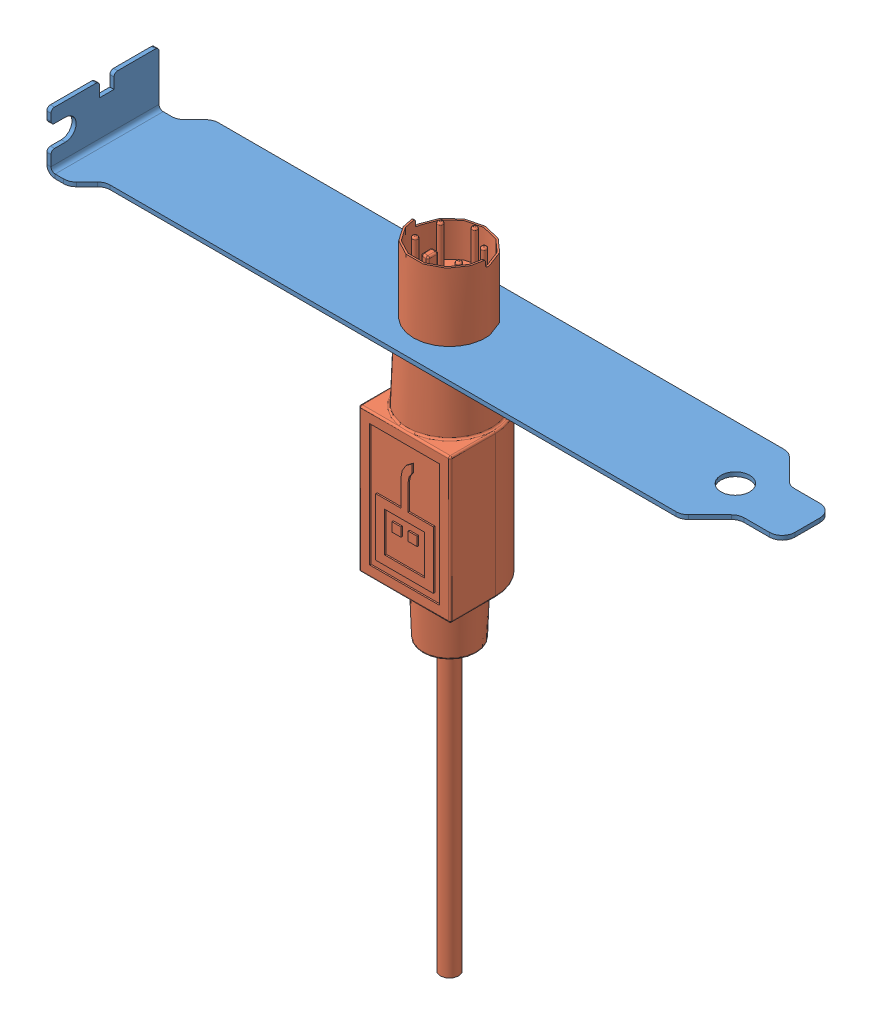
SolidWorks assembly sheetmetalsample.SLDASM, configuration Default (file format 13000). Lengths in mm.
Overall size (121.39 111.76 22.23).
2 component instances, 2 part files, 1 mates.
Components (placement in the parent):
- sheetmetalsample-1: sheetmetalsample.SLDPRT [Default] at origin size (121.39 10.26 22.23)
- plug-1: plug.SLDPRT [Default] at (51.0145 0 -9.7273) size (16.13 111.76 16)
Mates (geometry in assembly coordinates):
- Coincident2: coincident: plane of sheetmetalsample-1 through (0 0 0) normal (0 1 0); plane of plug-1 through (51.0145 0 -9.7273) normal (0 1 0)
